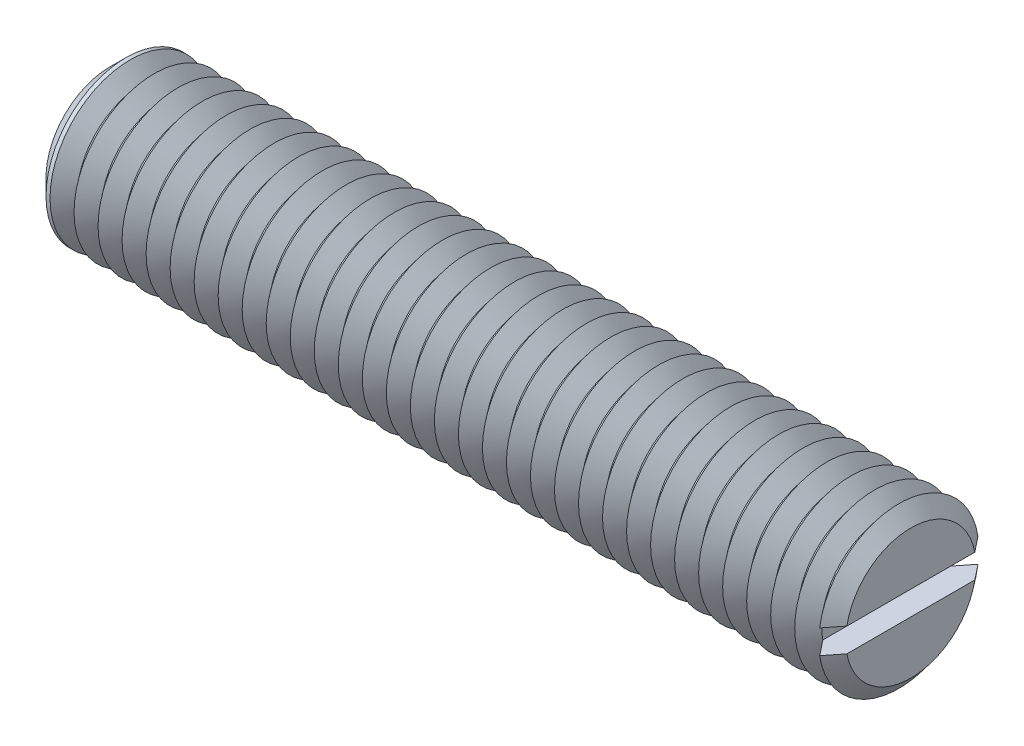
from build123d import *

# Parameters (mm, degrees)
SKETCH1_R       = 5
EXTRUDE1_DEPTH  = 25
SKETCH2_W       = 1.5
SKETCH2_H       = 1.5
EXTRUDE2_DEPTH  = 7.5
CHAMFER1_SIZE   = 1
LPATTERN1_COUNT = 33
LPATTERN1_PITCH = 1.5


with BuildPart() as part:
    # Sketch1 → Extrude1 (new, symmetric)
    with BuildSketch(Plane(origin=(0, 0, 0), x_dir=(0, 0, -1), z_dir=(1, 0, 0))):
        Circle(SKETCH1_R)
    extrude(amount=EXTRUDE1_DEPTH, both=True)

    # Sketch2 → Extrude2 (cut, symmetric)
    with BuildSketch(Plane.XY):
        with Locations((24.25, 0)):
            Rectangle(SKETCH2_W, SKETCH2_H)
    extrude(amount=EXTRUDE2_DEPTH, both=True, mode=Mode.SUBTRACT)

    # Chamfer1
    chamfer1_edges = [part.edges().sort_by_distance(p)[0] for p in [
        (-25, 0, 5),
    ]]
    chamfer(chamfer1_edges, length=CHAMFER1_SIZE)

    # Sketch3 → Cut-Revolve1 (revolve, cut)
    with BuildSketch(Plane.XY, mode=Mode.PRIVATE) as cut_revolve1_sk:
        Polygon((24.25, -5), (25.75, -5), (25, -4.0632503), align=None)
    cut_revolve1 = revolve(cut_revolve1_sk.sketch.rotate(Axis((0, 0, 0), (1, 0, 0)), 261.373073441), axis=Axis((0, 0, 0), (1, 0, 0)), mode=Mode.SUBTRACT)

    # LPattern1: Cut-Revolve1 ×33
    with Locations(*[(-i * LPATTERN1_PITCH, 0, 0) for i in range(1, LPATTERN1_COUNT)]):
        add(cut_revolve1, mode=Mode.SUBTRACT)


solid = part.part
